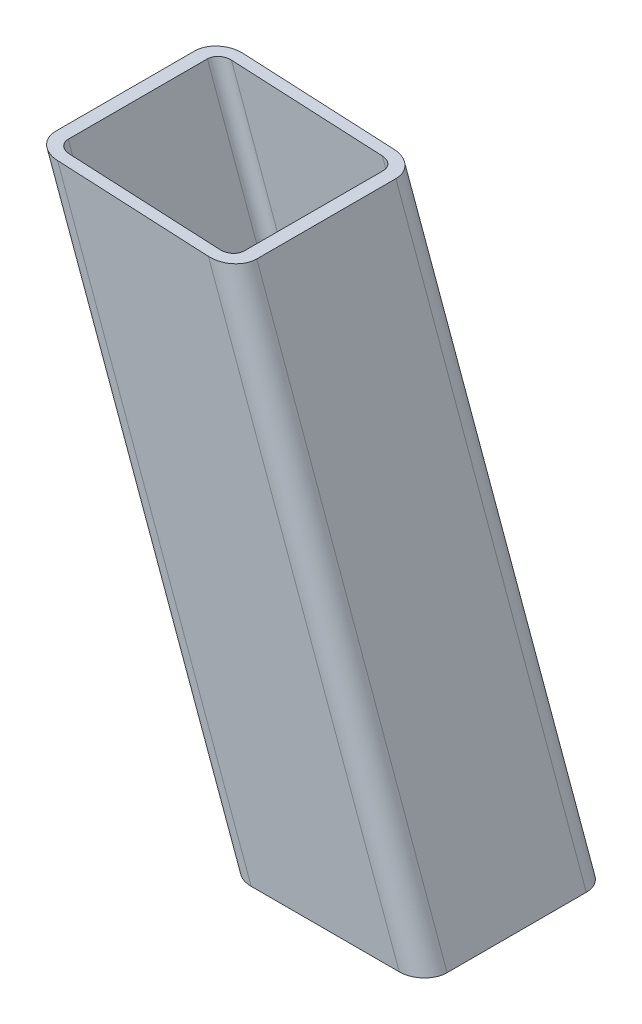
ISO-10303-21;
HEADER;
FILE_DESCRIPTION(('STEP AP214'),'2;1');
FILE_NAME('part.step','',(''),(''),'','','');
FILE_SCHEMA(('AUTOMOTIVE_DESIGN { 1 0 10303 214 1 1 1 1 }'));
ENDSEC;
DATA;
#1=APPLICATION_CONTEXT('core data for automotive mechanical design processes');
#2=APPLICATION_PROTOCOL_DEFINITION('international standard','automotive_design',2000,#1);
#3=PRODUCT_CONTEXT('',#1,'mechanical');
#4=PRODUCT('Part','Part','',(#3));
#5=PRODUCT_RELATED_PRODUCT_CATEGORY('part','',(#4));
#6=PRODUCT_DEFINITION_FORMATION('','',#4);
#7=PRODUCT_DEFINITION_CONTEXT('part definition',#1,'design');
#8=PRODUCT_DEFINITION('design','',#6,#7);
#9=PRODUCT_DEFINITION_SHAPE('','',#8);
#10=(LENGTH_UNIT() NAMED_UNIT(*) SI_UNIT(.MILLI.,.METRE.));
#11=(NAMED_UNIT(*) PLANE_ANGLE_UNIT() SI_UNIT($,.RADIAN.));
#12=(NAMED_UNIT(*) SI_UNIT($,.STERADIAN.) SOLID_ANGLE_UNIT());
#13=UNCERTAINTY_MEASURE_WITH_UNIT(LENGTH_MEASURE(1.E-05),#10,'distance_accuracy_value','');
#14=(GEOMETRIC_REPRESENTATION_CONTEXT(3) GLOBAL_UNCERTAINTY_ASSIGNED_CONTEXT((#13)) GLOBAL_UNIT_ASSIGNED_CONTEXT((#10,
#11,#12)) REPRESENTATION_CONTEXT('',''));
#15=CARTESIAN_POINT('',(0.,0.,0.));
#16=DIRECTION('',(0.,0.,1.));
#17=DIRECTION('',(1.,0.,0.));
#18=AXIS2_PLACEMENT_3D('',#15,#16,#17);
#19=CARTESIAN_POINT('',(1753.21678392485,13.6808057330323,30.));
#20=DIRECTION('',(-0.939692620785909,-0.342020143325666,0.));
#21=DIRECTION('',(0.342020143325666,-0.939692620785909,0.));
#22=AXIS2_PLACEMENT_3D('',#19,#20,#21);
#23=PLANE('',#22);
#24=DIRECTION('',(0.,0.,1.));
#25=VECTOR('',#24,1.);
#26=CARTESIAN_POINT('',(1737.44988663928,56.9999999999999,30.0000000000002));
#27=LINE('',#26,#25);
#28=CARTESIAN_POINT('',(1737.44988663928,57.,-30.));
#29=VERTEX_POINT('',#28);
#30=CARTESIAN_POINT('',(1737.44988663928,56.9999999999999,30.));
#31=VERTEX_POINT('',#30);
#32=EDGE_CURVE('E53',#29,#31,#27,.T.);
#33=ORIENTED_EDGE('',*,*,#32,.F.);
#34=DIRECTION('',(-0.342020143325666,0.939692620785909,0.));
#35=VECTOR('',#34,1.);
#36=CARTESIAN_POINT('',(1753.21678392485,13.6808057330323,-30.));
#37=LINE('',#36,#35);
#38=CARTESIAN_POINT('',(1655.37253947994,282.505657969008,-30.));
#39=VERTEX_POINT('',#38);
#40=EDGE_CURVE('E38',#29,#39,#37,.T.);
#41=ORIENTED_EDGE('',*,*,#40,.T.);
#42=DIRECTION('',(0.,0.,-1.));
#43=VECTOR('',#42,1.);
#44=CARTESIAN_POINT('',(1655.37253947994,282.505657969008,30.));
#45=LINE('',#44,#43);
#46=CARTESIAN_POINT('',(1655.37253947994,282.505657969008,30.));
#47=VERTEX_POINT('',#46);
#48=EDGE_CURVE('E107',#47,#39,#45,.T.);
#49=ORIENTED_EDGE('',*,*,#48,.F.);
#50=DIRECTION('',(-0.342020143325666,0.939692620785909,0.));
#51=VECTOR('',#50,1.);
#52=CARTESIAN_POINT('',(1753.21678392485,13.6808057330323,30.));
#53=LINE('',#52,#51);
#54=EDGE_CURVE('E185',#31,#47,#53,.T.);
#55=ORIENTED_EDGE('',*,*,#54,.F.);
#56=EDGE_LOOP('',(#33,#41,#49,#55));
#57=FACE_BOUND('',#56,.T.);
#58=ADVANCED_FACE('F34',(#57),#23,.F.);
#59=CARTESIAN_POINT('',(1743.81985771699,10.2606042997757,-30.));
#60=DIRECTION('',(-0.342020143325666,0.939692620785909,0.));
#61=DIRECTION('',(-0.939692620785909,-0.342020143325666,0.));
#62=AXIS2_PLACEMENT_3D('',#59,#60,#61);
#63=CYLINDRICAL_SURFACE('',#62,10.);
#64=CARTESIAN_POINT('',(1726.80810891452,57.0000000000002,-30.));
#65=DIRECTION('',(0.,-1.,0.));
#66=DIRECTION('',(-1.,0.,0.));
#67=AXIS2_PLACEMENT_3D('',#64,#65,#66);
#68=ELLIPSE('',#67,10.6417777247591,10.);
#69=CARTESIAN_POINT('',(1726.80810891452,57.0000000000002,-40.));
#70=VERTEX_POINT('',#69);
#71=EDGE_CURVE('E155',#70,#29,#68,.T.);
#72=ORIENTED_EDGE('',*,*,#71,.F.);
#73=DIRECTION('',(-0.342020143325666,0.939692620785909,0.));
#74=VECTOR('',#73,1.);
#75=CARTESIAN_POINT('',(1743.81985771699,10.2606042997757,-40.));
#76=LINE('',#75,#74);
#77=CARTESIAN_POINT('',(1644.53323300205,283.048363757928,-40.));
#78=VERTEX_POINT('',#77);
#79=EDGE_CURVE('E165',#70,#78,#76,.T.);
#80=ORIENTED_EDGE('',*,*,#79,.T.);
#81=CARTESIAN_POINT('',(1644.53323300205,283.048363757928,-30.));
#82=DIRECTION('',(0.0500056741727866,0.998748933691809,0.));
#83=DIRECTION('',(-0.998748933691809,0.0500056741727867,0.));
#84=AXIS2_PLACEMENT_3D('',#81,#82,#83);
#85=ELLIPSE('',#84,10.8528841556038,10.);
#86=EDGE_CURVE('E102',#39,#78,#85,.T.);
#87=ORIENTED_EDGE('',*,*,#86,.F.);
#88=ORIENTED_EDGE('',*,*,#40,.F.);
#89=EDGE_LOOP('',(#72,#80,#87,#88));
#90=FACE_BOUND('',#89,.T.);
#91=ADVANCED_FACE('F164',(#90),#63,.T.);
#92=CARTESIAN_POINT('',(1687.43830046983,-10.2606042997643,-40.));
#93=DIRECTION('',(0.,0.,1.));
#94=DIRECTION('',(1.,0.,0.));
#95=AXIS2_PLACEMENT_3D('',#92,#93,#94);
#96=PLANE('',#95);
#97=DIRECTION('',(1.,0.,0.));
#98=VECTOR('',#97,1.);
#99=CARTESIAN_POINT('',(1687.43830046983,57.0000000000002,-40.));
#100=LINE('',#99,#98);
#101=CARTESIAN_POINT('',(1662.95744256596,57.0000000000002,-40.));
#102=VERTEX_POINT('',#101);
#103=EDGE_CURVE('E152',#102,#70,#100,.T.);
#104=ORIENTED_EDGE('',*,*,#103,.F.);
#105=DIRECTION('',(-0.342020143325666,0.939692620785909,0.));
#106=VECTOR('',#105,1.);
#107=CARTESIAN_POINT('',(1687.43830046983,-10.2606042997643,-40.));
#108=LINE('',#107,#106);
#109=CARTESIAN_POINT('',(1579.49739413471,286.304598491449,-40.));
#110=VERTEX_POINT('',#109);
#111=EDGE_CURVE('E170',#102,#110,#108,.T.);
#112=ORIENTED_EDGE('',*,*,#111,.T.);
#113=DIRECTION('',(-0.998748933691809,0.0500056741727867,0.));
#114=VECTOR('',#113,1.);
#115=CARTESIAN_POINT('',(1701.97977661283,280.1721122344,-40.));
#116=LINE('',#115,#114);
#117=EDGE_CURVE('E169',#78,#110,#116,.T.);
#118=ORIENTED_EDGE('',*,*,#117,.F.);
#119=ORIENTED_EDGE('',*,*,#79,.F.);
#120=EDGE_LOOP('',(#104,#112,#118,#119));
#121=FACE_BOUND('',#120,.T.);
#122=ADVANCED_FACE('F168',(#121),#96,.F.);
#123=CARTESIAN_POINT('',(1687.43830046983,-10.2606042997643,-30.));
#124=DIRECTION('',(-0.342020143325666,0.939692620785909,0.));
#125=DIRECTION('',(-0.939692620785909,-0.342020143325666,0.));
#126=AXIS2_PLACEMENT_3D('',#123,#124,#125);
#127=CYLINDRICAL_SURFACE('',#126,10.);
#128=CARTESIAN_POINT('',(1662.95744256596,57.0000000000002,-30.));
#129=DIRECTION('',(0.,-1.,0.));
#130=DIRECTION('',(-1.,0.,0.));
#131=AXIS2_PLACEMENT_3D('',#128,#129,#130);
#132=ELLIPSE('',#131,10.6417777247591,10.);
#133=CARTESIAN_POINT('',(1652.3156648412,57.0000000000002,-30.));
#134=VERTEX_POINT('',#133);
#135=EDGE_CURVE('E150',#134,#102,#132,.T.);
#136=ORIENTED_EDGE('',*,*,#135,.F.);
#137=DIRECTION('',(-0.342020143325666,0.939692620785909,0.));
#138=VECTOR('',#137,1.);
#139=CARTESIAN_POINT('',(1678.04137426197,-13.680805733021,-30.));
#140=LINE('',#139,#138);
#141=CARTESIAN_POINT('',(1568.65808765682,286.847304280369,-30.));
#142=VERTEX_POINT('',#141);
#143=EDGE_CURVE('E171',#134,#142,#140,.T.);
#144=ORIENTED_EDGE('',*,*,#143,.T.);
#145=CARTESIAN_POINT('',(1579.49739413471,286.304598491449,-30.));
#146=DIRECTION('',(0.0500056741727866,0.998748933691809,0.));
#147=DIRECTION('',(-0.998748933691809,0.0500056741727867,0.));
#148=AXIS2_PLACEMENT_3D('',#145,#146,#147);
#149=ELLIPSE('',#148,10.8528841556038,10.);
#150=EDGE_CURVE('E228',#110,#142,#149,.T.);
#151=ORIENTED_EDGE('',*,*,#150,.F.);
#152=ORIENTED_EDGE('',*,*,#111,.F.);
#153=EDGE_LOOP('',(#136,#144,#151,#152));
#154=FACE_BOUND('',#153,.T.);
#155=ADVANCED_FACE('F325',(#154),#127,.T.);
#156=CARTESIAN_POINT('',(1678.04137426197,-13.680805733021,-30.));
#157=DIRECTION('',(0.939692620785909,0.342020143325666,0.));
#158=DIRECTION('',(-0.342020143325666,0.939692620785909,0.));
#159=AXIS2_PLACEMENT_3D('',#156,#157,#158);
#160=PLANE('',#159);
#161=DIRECTION('',(0.,0.,-1.));
#162=VECTOR('',#161,1.);
#163=CARTESIAN_POINT('',(1652.3156648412,57.0000000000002,-29.9999999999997));
#164=LINE('',#163,#162);
#165=CARTESIAN_POINT('',(1652.3156648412,56.9999999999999,30.));
#166=VERTEX_POINT('',#165);
#167=EDGE_CURVE('E253',#166,#134,#164,.T.);
#168=ORIENTED_EDGE('',*,*,#167,.F.);
#169=DIRECTION('',(-0.342020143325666,0.939692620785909,0.));
#170=VECTOR('',#169,1.);
#171=CARTESIAN_POINT('',(1678.04137426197,-13.6808057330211,30.));
#172=LINE('',#171,#170);
#173=CARTESIAN_POINT('',(1568.65808765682,286.847304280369,30.));
#174=VERTEX_POINT('',#173);
#175=EDGE_CURVE('E176',#166,#174,#172,.T.);
#176=ORIENTED_EDGE('',*,*,#175,.T.);
#177=DIRECTION('',(0.,0.,1.));
#178=VECTOR('',#177,1.);
#179=CARTESIAN_POINT('',(1568.65808765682,286.847304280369,-30.0000000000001));
#180=LINE('',#179,#178);
#181=EDGE_CURVE('E230',#142,#174,#180,.T.);
#182=ORIENTED_EDGE('',*,*,#181,.F.);
#183=ORIENTED_EDGE('',*,*,#143,.F.);
#184=EDGE_LOOP('',(#168,#176,#182,#183));
#185=FACE_BOUND('',#184,.T.);
#186=ADVANCED_FACE('F328',(#185),#160,.F.);
#187=CARTESIAN_POINT('',(1687.43830046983,-10.2606042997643,30.));
#188=DIRECTION('',(-0.342020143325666,0.939692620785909,0.));
#189=DIRECTION('',(-0.939692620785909,-0.342020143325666,0.));
#190=AXIS2_PLACEMENT_3D('',#187,#188,#189);
#191=CYLINDRICAL_SURFACE('',#190,10.);
#192=CARTESIAN_POINT('',(1662.95744256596,56.9999999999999,30.));
#193=DIRECTION('',(0.,-1.,0.));
#194=DIRECTION('',(-1.,0.,0.));
#195=AXIS2_PLACEMENT_3D('',#192,#193,#194);
#196=ELLIPSE('',#195,10.6417777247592,10.);
#197=CARTESIAN_POINT('',(1662.95744256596,56.9999999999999,40.));
#198=VERTEX_POINT('',#197);
#199=EDGE_CURVE('E255',#198,#166,#196,.T.);
#200=ORIENTED_EDGE('',*,*,#199,.F.);
#201=DIRECTION('',(-0.342020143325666,0.939692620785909,0.));
#202=VECTOR('',#201,1.);
#203=CARTESIAN_POINT('',(1687.43830046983,-10.2606042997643,40.));
#204=LINE('',#203,#202);
#205=CARTESIAN_POINT('',(1579.49739413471,286.304598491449,40.));
#206=VERTEX_POINT('',#205);
#207=EDGE_CURVE('E179',#198,#206,#204,.T.);
#208=ORIENTED_EDGE('',*,*,#207,.T.);
#209=CARTESIAN_POINT('',(1579.49739413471,286.304598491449,30.));
#210=DIRECTION('',(0.0500056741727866,0.998748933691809,0.));
#211=DIRECTION('',(-0.998748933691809,0.0500056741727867,0.));
#212=AXIS2_PLACEMENT_3D('',#209,#210,#211);
#213=ELLIPSE('',#212,10.8528841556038,10.);
#214=EDGE_CURVE('E232',#174,#206,#213,.T.);
#215=ORIENTED_EDGE('',*,*,#214,.F.);
#216=ORIENTED_EDGE('',*,*,#175,.F.);
#217=EDGE_LOOP('',(#200,#208,#215,#216));
#218=FACE_BOUND('',#217,.T.);
#219=ADVANCED_FACE('F332',(#218),#191,.T.);
#220=CARTESIAN_POINT('',(1743.81985771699,10.2606042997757,40.));
#221=DIRECTION('',(0.,0.,-1.));
#222=DIRECTION('',(-1.,0.,0.));
#223=AXIS2_PLACEMENT_3D('',#220,#221,#222);
#224=PLANE('',#223);
#225=DIRECTION('',(-1.,0.,0.));
#226=VECTOR('',#225,1.);
#227=CARTESIAN_POINT('',(1743.81985771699,56.9999999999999,40.));
#228=LINE('',#227,#226);
#229=CARTESIAN_POINT('',(1726.80810891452,56.9999999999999,40.));
#230=VERTEX_POINT('',#229);
#231=EDGE_CURVE('E257',#230,#198,#228,.T.);
#232=ORIENTED_EDGE('',*,*,#231,.F.);
#233=DIRECTION('',(-0.342020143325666,0.939692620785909,0.));
#234=VECTOR('',#233,1.);
#235=CARTESIAN_POINT('',(1743.81985771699,10.2606042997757,40.));
#236=LINE('',#235,#234);
#237=CARTESIAN_POINT('',(1644.53323300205,283.048363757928,40.));
#238=VERTEX_POINT('',#237);
#239=EDGE_CURVE('E182',#230,#238,#236,.T.);
#240=ORIENTED_EDGE('',*,*,#239,.T.);
#241=DIRECTION('',(0.998748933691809,-0.0500056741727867,0.));
#242=VECTOR('',#241,1.);
#243=CARTESIAN_POINT('',(1757.19545491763,277.407556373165,40.));
#244=LINE('',#243,#242);
#245=EDGE_CURVE('E234',#206,#238,#244,.T.);
#246=ORIENTED_EDGE('',*,*,#245,.F.);
#247=ORIENTED_EDGE('',*,*,#207,.F.);
#248=EDGE_LOOP('',(#232,#240,#246,#247));
#249=FACE_BOUND('',#248,.T.);
#250=ADVANCED_FACE('F335',(#249),#224,.F.);
#251=CARTESIAN_POINT('',(1743.81985771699,10.2606042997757,30.));
#252=DIRECTION('',(-0.342020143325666,0.939692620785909,0.));
#253=DIRECTION('',(-0.939692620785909,-0.342020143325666,0.));
#254=AXIS2_PLACEMENT_3D('',#251,#252,#253);
#255=CYLINDRICAL_SURFACE('',#254,10.);
#256=CARTESIAN_POINT('',(1726.80810891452,56.9999999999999,30.));
#257=DIRECTION('',(0.,-1.,0.));
#258=DIRECTION('',(-1.,0.,0.));
#259=AXIS2_PLACEMENT_3D('',#256,#257,#258);
#260=ELLIPSE('',#259,10.6417777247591,10.);
#261=EDGE_CURVE('E236',#31,#230,#260,.T.);
#262=ORIENTED_EDGE('',*,*,#261,.F.);
#263=ORIENTED_EDGE('',*,*,#54,.T.);
#264=CARTESIAN_POINT('',(1644.53323300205,283.048363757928,30.));
#265=DIRECTION('',(0.0500056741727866,0.998748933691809,0.));
#266=DIRECTION('',(-0.998748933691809,0.0500056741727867,0.));
#267=AXIS2_PLACEMENT_3D('',#264,#265,#266);
#268=ELLIPSE('',#267,10.8528841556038,10.);
#269=EDGE_CURVE('E110',#238,#47,#268,.T.);
#270=ORIENTED_EDGE('',*,*,#269,.F.);
#271=ORIENTED_EDGE('',*,*,#239,.F.);
#272=EDGE_LOOP('',(#262,#263,#270,#271));
#273=FACE_BOUND('',#272,.T.);
#274=ADVANCED_FACE('F36',(#273),#255,.T.);
#275=CARTESIAN_POINT('',(6158.08276398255,57.0625533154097,-40.));
#276=DIRECTION('',(0.0500056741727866,0.998748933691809,0.));
#277=DIRECTION('',(-0.998748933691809,0.0500056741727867,0.));
#278=AXIS2_PLACEMENT_3D('',#275,#276,#277);
#279=PLANE('',#278);
#280=DIRECTION('',(0.,0.,1.));
#281=VECTOR('',#280,1.);
#282=CARTESIAN_POINT('',(1574.07774089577,286.575951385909,-30.));
#283=LINE('',#282,#281);
#284=CARTESIAN_POINT('',(1574.07774089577,286.575951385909,-30.));
#285=VERTEX_POINT('',#284);
#286=CARTESIAN_POINT('',(1574.07774089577,286.575951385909,30.));
#287=VERTEX_POINT('',#286);
#288=EDGE_CURVE('E191',#285,#287,#283,.T.);
#289=ORIENTED_EDGE('',*,*,#288,.F.);
#290=CARTESIAN_POINT('',(1579.49739413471,286.304598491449,-30.));
#291=DIRECTION('',(0.0500056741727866,0.998748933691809,0.));
#292=DIRECTION('',(-0.998748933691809,0.0500056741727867,0.));
#293=AXIS2_PLACEMENT_3D('',#290,#291,#292);
#294=ELLIPSE('',#293,5.4264420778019,5.00000000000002);
#295=CARTESIAN_POINT('',(1579.49739413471,286.304598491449,-35.));
#296=VERTEX_POINT('',#295);
#297=EDGE_CURVE('E196',#296,#285,#294,.T.);
#298=ORIENTED_EDGE('',*,*,#297,.F.);
#299=DIRECTION('',(-0.998748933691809,0.0500056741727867,0.));
#300=VECTOR('',#299,1.);
#301=CARTESIAN_POINT('',(1701.97977661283,280.1721122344,-35.));
#302=LINE('',#301,#300);
#303=CARTESIAN_POINT('',(1644.53323300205,283.048363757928,-35.));
#304=VERTEX_POINT('',#303);
#305=EDGE_CURVE('E201',#304,#296,#302,.T.);
#306=ORIENTED_EDGE('',*,*,#305,.F.);
#307=CARTESIAN_POINT('',(1644.53323300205,283.048363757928,-30.));
#308=DIRECTION('',(0.0500056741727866,0.998748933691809,0.));
#309=DIRECTION('',(-0.998748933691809,0.0500056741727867,0.));
#310=AXIS2_PLACEMENT_3D('',#307,#308,#309);
#311=ELLIPSE('',#310,5.42644207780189,5.00000000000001);
#312=CARTESIAN_POINT('',(1649.952886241,282.777010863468,-30.));
#313=VERTEX_POINT('',#312);
#314=EDGE_CURVE('E206',#313,#304,#311,.T.);
#315=ORIENTED_EDGE('',*,*,#314,.F.);
#316=DIRECTION('',(0.,0.,-1.));
#317=VECTOR('',#316,1.);
#318=CARTESIAN_POINT('',(1649.952886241,282.777010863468,30.));
#319=LINE('',#318,#317);
#320=CARTESIAN_POINT('',(1649.952886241,282.777010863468,30.));
#321=VERTEX_POINT('',#320);
#322=EDGE_CURVE('E211',#321,#313,#319,.T.);
#323=ORIENTED_EDGE('',*,*,#322,.F.);
#324=CARTESIAN_POINT('',(1644.53323300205,283.048363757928,30.));
#325=DIRECTION('',(0.0500056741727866,0.998748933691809,0.));
#326=DIRECTION('',(-0.998748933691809,0.0500056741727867,0.));
#327=AXIS2_PLACEMENT_3D('',#324,#325,#326);
#328=ELLIPSE('',#327,5.42644207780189,5.00000000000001);
#329=CARTESIAN_POINT('',(1644.53323300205,283.048363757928,35.));
#330=VERTEX_POINT('',#329);
#331=EDGE_CURVE('E216',#330,#321,#328,.T.);
#332=ORIENTED_EDGE('',*,*,#331,.F.);
#333=DIRECTION('',(0.998748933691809,-0.0500056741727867,0.));
#334=VECTOR('',#333,1.);
#335=CARTESIAN_POINT('',(1757.19545491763,277.407556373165,35.));
#336=LINE('',#335,#334);
#337=CARTESIAN_POINT('',(1579.49739413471,286.304598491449,35.));
#338=VERTEX_POINT('',#337);
#339=EDGE_CURVE('E221',#338,#330,#336,.T.);
#340=ORIENTED_EDGE('',*,*,#339,.F.);
#341=CARTESIAN_POINT('',(1579.49739413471,286.304598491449,30.));
#342=DIRECTION('',(0.0500056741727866,0.998748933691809,0.));
#343=DIRECTION('',(-0.998748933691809,0.0500056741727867,0.));
#344=AXIS2_PLACEMENT_3D('',#341,#342,#343);
#345=ELLIPSE('',#344,5.42644207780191,5.00000000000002);
#346=EDGE_CURVE('E11',#287,#338,#345,.T.);
#347=ORIENTED_EDGE('',*,*,#346,.F.);
#348=EDGE_LOOP('',(#289,#298,#306,#315,#323,#332,#340,#347));
#349=FACE_BOUND('',#348,.T.);
#350=ORIENTED_EDGE('',*,*,#269,.T.);
#351=ORIENTED_EDGE('',*,*,#48,.T.);
#352=ORIENTED_EDGE('',*,*,#86,.T.);
#353=ORIENTED_EDGE('',*,*,#117,.T.);
#354=ORIENTED_EDGE('',*,*,#150,.T.);
#355=ORIENTED_EDGE('',*,*,#181,.T.);
#356=ORIENTED_EDGE('',*,*,#214,.T.);
#357=ORIENTED_EDGE('',*,*,#245,.T.);
#358=EDGE_LOOP('',(#350,#351,#352,#353,#354,#355,#356,#357));
#359=FACE_BOUND('',#358,.T.);
#360=ADVANCED_FACE('F286',(#349,#359),#279,.T.);
#361=CARTESIAN_POINT('',(9149.96897120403,57.0000000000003,-59.9999999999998));
#362=DIRECTION('',(0.,-1.,0.));
#363=DIRECTION('',(0.,0.,-1.));
#364=AXIS2_PLACEMENT_3D('',#361,#362,#363);
#365=PLANE('',#364);
#366=DIRECTION('',(-1.,0.,0.));
#367=VECTOR('',#366,1.);
#368=CARTESIAN_POINT('',(1743.81985771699,56.9999999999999,35.));
#369=LINE('',#368,#367);
#370=CARTESIAN_POINT('',(1726.80810891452,56.9999999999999,35.));
#371=VERTEX_POINT('',#370);
#372=CARTESIAN_POINT('',(1662.95744256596,56.9999999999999,35.));
#373=VERTEX_POINT('',#372);
#374=EDGE_CURVE('E222',#371,#373,#369,.T.);
#375=ORIENTED_EDGE('',*,*,#374,.F.);
#376=CARTESIAN_POINT('',(1726.80810891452,56.9999999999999,30.));
#377=DIRECTION('',(0.,-1.,0.));
#378=DIRECTION('',(-1.,0.,0.));
#379=AXIS2_PLACEMENT_3D('',#376,#377,#378);
#380=ELLIPSE('',#379,5.32088886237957,5.00000000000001);
#381=CARTESIAN_POINT('',(1732.1289977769,56.9999999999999,30.));
#382=VERTEX_POINT('',#381);
#383=EDGE_CURVE('E217',#382,#371,#380,.T.);
#384=ORIENTED_EDGE('',*,*,#383,.F.);
#385=DIRECTION('',(0.,0.,1.));
#386=VECTOR('',#385,1.);
#387=CARTESIAN_POINT('',(1732.1289977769,56.9999999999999,30.0000000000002));
#388=LINE('',#387,#386);
#389=CARTESIAN_POINT('',(1732.1289977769,57.0000000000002,-30.));
#390=VERTEX_POINT('',#389);
#391=EDGE_CURVE('E212',#390,#382,#388,.T.);
#392=ORIENTED_EDGE('',*,*,#391,.F.);
#393=CARTESIAN_POINT('',(1726.80810891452,57.0000000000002,-30.));
#394=DIRECTION('',(0.,-1.,0.));
#395=DIRECTION('',(-1.,0.,0.));
#396=AXIS2_PLACEMENT_3D('',#393,#394,#395);
#397=ELLIPSE('',#396,5.32088886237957,5.00000000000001);
#398=CARTESIAN_POINT('',(1726.80810891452,57.0000000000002,-35.));
#399=VERTEX_POINT('',#398);
#400=EDGE_CURVE('E207',#399,#390,#397,.T.);
#401=ORIENTED_EDGE('',*,*,#400,.F.);
#402=DIRECTION('',(1.,0.,0.));
#403=VECTOR('',#402,1.);
#404=CARTESIAN_POINT('',(1687.43830046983,57.0000000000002,-35.));
#405=LINE('',#404,#403);
#406=CARTESIAN_POINT('',(1662.95744256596,57.0000000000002,-35.));
#407=VERTEX_POINT('',#406);
#408=EDGE_CURVE('E202',#407,#399,#405,.T.);
#409=ORIENTED_EDGE('',*,*,#408,.F.);
#410=CARTESIAN_POINT('',(1662.95744256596,57.0000000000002,-30.));
#411=DIRECTION('',(0.,-1.,0.));
#412=DIRECTION('',(-1.,0.,0.));
#413=AXIS2_PLACEMENT_3D('',#410,#411,#412);
#414=ELLIPSE('',#413,5.32088886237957,5.00000000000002);
#415=CARTESIAN_POINT('',(1657.63655370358,57.0000000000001,-30.));
#416=VERTEX_POINT('',#415);
#417=EDGE_CURVE('E197',#416,#407,#414,.T.);
#418=ORIENTED_EDGE('',*,*,#417,.F.);
#419=DIRECTION('',(0.,0.,-1.));
#420=VECTOR('',#419,1.);
#421=CARTESIAN_POINT('',(1657.63655370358,57.0000000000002,-29.9999999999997));
#422=LINE('',#421,#420);
#423=CARTESIAN_POINT('',(1657.63655370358,56.9999999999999,30.));
#424=VERTEX_POINT('',#423);
#425=EDGE_CURVE('E192',#424,#416,#422,.T.);
#426=ORIENTED_EDGE('',*,*,#425,.F.);
#427=CARTESIAN_POINT('',(1662.95744256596,56.9999999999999,30.));
#428=DIRECTION('',(0.,-1.,0.));
#429=DIRECTION('',(-1.,0.,0.));
#430=AXIS2_PLACEMENT_3D('',#427,#428,#429);
#431=ELLIPSE('',#430,5.32088886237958,5.00000000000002);
#432=EDGE_CURVE('E225',#373,#424,#431,.T.);
#433=ORIENTED_EDGE('',*,*,#432,.F.);
#434=EDGE_LOOP('',(#375,#384,#392,#401,#409,#418,#426,#433));
#435=FACE_BOUND('',#434,.T.);
#436=ORIENTED_EDGE('',*,*,#261,.T.);
#437=ORIENTED_EDGE('',*,*,#231,.T.);
#438=ORIENTED_EDGE('',*,*,#199,.T.);
#439=ORIENTED_EDGE('',*,*,#167,.T.);
#440=ORIENTED_EDGE('',*,*,#135,.T.);
#441=ORIENTED_EDGE('',*,*,#103,.T.);
#442=ORIENTED_EDGE('',*,*,#71,.T.);
#443=ORIENTED_EDGE('',*,*,#32,.T.);
#444=EDGE_LOOP('',(#436,#437,#438,#439,#440,#441,#442,#443));
#445=FACE_BOUND('',#444,.T.);
#446=ADVANCED_FACE('F154',(#435,#445),#365,.T.);
#447=CARTESIAN_POINT('',(1682.7398373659,-11.9707050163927,-30.));
#448=DIRECTION('',(0.939692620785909,0.342020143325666,0.));
#449=DIRECTION('',(-0.342020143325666,0.939692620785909,0.));
#450=AXIS2_PLACEMENT_3D('',#447,#448,#449);
#451=PLANE('',#450);
#452=DIRECTION('',(-0.342020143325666,0.939692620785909,0.));
#453=VECTOR('',#452,1.);
#454=CARTESIAN_POINT('',(1682.7398373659,-11.9707050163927,30.));
#455=LINE('',#454,#453);
#456=EDGE_CURVE('E44',#424,#287,#455,.T.);
#457=ORIENTED_EDGE('',*,*,#456,.F.);
#458=ORIENTED_EDGE('',*,*,#425,.T.);
#459=DIRECTION('',(-0.342020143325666,0.939692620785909,0.));
#460=VECTOR('',#459,1.);
#461=CARTESIAN_POINT('',(1682.7398373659,-11.9707050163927,-30.));
#462=LINE('',#461,#460);
#463=EDGE_CURVE('E188',#416,#285,#462,.T.);
#464=ORIENTED_EDGE('',*,*,#463,.T.);
#465=ORIENTED_EDGE('',*,*,#288,.T.);
#466=EDGE_LOOP('',(#457,#458,#464,#465));
#467=FACE_BOUND('',#466,.T.);
#468=ADVANCED_FACE('F283',(#467),#451,.T.);
#469=CARTESIAN_POINT('',(1687.43830046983,-10.2606042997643,-30.));
#470=DIRECTION('',(-0.342020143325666,0.939692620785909,0.));
#471=DIRECTION('',(-0.939692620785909,-0.342020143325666,0.));
#472=AXIS2_PLACEMENT_3D('',#469,#470,#471);
#473=CYLINDRICAL_SURFACE('',#472,5.00000000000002);
#474=ORIENTED_EDGE('',*,*,#463,.F.);
#475=ORIENTED_EDGE('',*,*,#417,.T.);
#476=DIRECTION('',(-0.342020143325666,0.939692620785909,0.));
#477=VECTOR('',#476,1.);
#478=CARTESIAN_POINT('',(1687.43830046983,-10.2606042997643,-35.));
#479=LINE('',#478,#477);
#480=EDGE_CURVE('E193',#407,#296,#479,.T.);
#481=ORIENTED_EDGE('',*,*,#480,.T.);
#482=ORIENTED_EDGE('',*,*,#297,.T.);
#483=EDGE_LOOP('',(#474,#475,#481,#482));
#484=FACE_BOUND('',#483,.T.);
#485=ADVANCED_FACE('F288',(#484),#473,.F.);
#486=CARTESIAN_POINT('',(1687.43830046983,-10.2606042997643,-35.));
#487=DIRECTION('',(0.,0.,1.));
#488=DIRECTION('',(1.,0.,0.));
#489=AXIS2_PLACEMENT_3D('',#486,#487,#488);
#490=PLANE('',#489);
#491=ORIENTED_EDGE('',*,*,#480,.F.);
#492=ORIENTED_EDGE('',*,*,#408,.T.);
#493=DIRECTION('',(-0.342020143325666,0.939692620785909,0.));
#494=VECTOR('',#493,1.);
#495=CARTESIAN_POINT('',(1743.81985771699,10.2606042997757,-35.));
#496=LINE('',#495,#494);
#497=EDGE_CURVE('E198',#399,#304,#496,.T.);
#498=ORIENTED_EDGE('',*,*,#497,.T.);
#499=ORIENTED_EDGE('',*,*,#305,.T.);
#500=EDGE_LOOP('',(#491,#492,#498,#499));
#501=FACE_BOUND('',#500,.T.);
#502=ADVANCED_FACE('F292',(#501),#490,.T.);
#503=CARTESIAN_POINT('',(1743.81985771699,10.2606042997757,-30.));
#504=DIRECTION('',(-0.342020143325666,0.939692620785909,0.));
#505=DIRECTION('',(-0.939692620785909,-0.342020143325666,0.));
#506=AXIS2_PLACEMENT_3D('',#503,#504,#505);
#507=CYLINDRICAL_SURFACE('',#506,5.00000000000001);
#508=ORIENTED_EDGE('',*,*,#497,.F.);
#509=ORIENTED_EDGE('',*,*,#400,.T.);
#510=DIRECTION('',(-0.342020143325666,0.939692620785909,0.));
#511=VECTOR('',#510,1.);
#512=CARTESIAN_POINT('',(1748.51832082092,11.970705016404,-30.));
#513=LINE('',#512,#511);
#514=EDGE_CURVE('E203',#390,#313,#513,.T.);
#515=ORIENTED_EDGE('',*,*,#514,.T.);
#516=ORIENTED_EDGE('',*,*,#314,.T.);
#517=EDGE_LOOP('',(#508,#509,#515,#516));
#518=FACE_BOUND('',#517,.T.);
#519=ADVANCED_FACE('F295',(#518),#507,.F.);
#520=CARTESIAN_POINT('',(1748.51832082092,11.970705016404,30.));
#521=DIRECTION('',(-0.939692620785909,-0.342020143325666,0.));
#522=DIRECTION('',(0.342020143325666,-0.939692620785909,0.));
#523=AXIS2_PLACEMENT_3D('',#520,#521,#522);
#524=PLANE('',#523);
#525=ORIENTED_EDGE('',*,*,#514,.F.);
#526=ORIENTED_EDGE('',*,*,#391,.T.);
#527=DIRECTION('',(-0.342020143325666,0.939692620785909,0.));
#528=VECTOR('',#527,1.);
#529=CARTESIAN_POINT('',(1748.51832082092,11.970705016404,30.));
#530=LINE('',#529,#528);
#531=EDGE_CURVE('E208',#382,#321,#530,.T.);
#532=ORIENTED_EDGE('',*,*,#531,.T.);
#533=ORIENTED_EDGE('',*,*,#322,.T.);
#534=EDGE_LOOP('',(#525,#526,#532,#533));
#535=FACE_BOUND('',#534,.T.);
#536=ADVANCED_FACE('F298',(#535),#524,.T.);
#537=CARTESIAN_POINT('',(1743.81985771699,10.2606042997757,30.));
#538=DIRECTION('',(-0.342020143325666,0.939692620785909,0.));
#539=DIRECTION('',(-0.939692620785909,-0.342020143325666,0.));
#540=AXIS2_PLACEMENT_3D('',#537,#538,#539);
#541=CYLINDRICAL_SURFACE('',#540,5.00000000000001);
#542=ORIENTED_EDGE('',*,*,#531,.F.);
#543=ORIENTED_EDGE('',*,*,#383,.T.);
#544=DIRECTION('',(-0.342020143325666,0.939692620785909,0.));
#545=VECTOR('',#544,1.);
#546=CARTESIAN_POINT('',(1743.81985771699,10.2606042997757,35.));
#547=LINE('',#546,#545);
#548=EDGE_CURVE('E213',#371,#330,#547,.T.);
#549=ORIENTED_EDGE('',*,*,#548,.T.);
#550=ORIENTED_EDGE('',*,*,#331,.T.);
#551=EDGE_LOOP('',(#542,#543,#549,#550));
#552=FACE_BOUND('',#551,.T.);
#553=ADVANCED_FACE('F301',(#552),#541,.F.);
#554=CARTESIAN_POINT('',(1743.81985771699,10.2606042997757,35.));
#555=DIRECTION('',(0.,0.,-1.));
#556=DIRECTION('',(-1.,0.,0.));
#557=AXIS2_PLACEMENT_3D('',#554,#555,#556);
#558=PLANE('',#557);
#559=ORIENTED_EDGE('',*,*,#548,.F.);
#560=ORIENTED_EDGE('',*,*,#374,.T.);
#561=DIRECTION('',(-0.342020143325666,0.939692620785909,0.));
#562=VECTOR('',#561,1.);
#563=CARTESIAN_POINT('',(1687.43830046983,-10.2606042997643,35.));
#564=LINE('',#563,#562);
#565=EDGE_CURVE('E218',#373,#338,#564,.T.);
#566=ORIENTED_EDGE('',*,*,#565,.T.);
#567=ORIENTED_EDGE('',*,*,#339,.T.);
#568=EDGE_LOOP('',(#559,#560,#566,#567));
#569=FACE_BOUND('',#568,.T.);
#570=ADVANCED_FACE('F304',(#569),#558,.T.);
#571=CARTESIAN_POINT('',(1687.43830046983,-10.2606042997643,30.));
#572=DIRECTION('',(-0.342020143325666,0.939692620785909,0.));
#573=DIRECTION('',(-0.939692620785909,-0.342020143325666,0.));
#574=AXIS2_PLACEMENT_3D('',#571,#572,#573);
#575=CYLINDRICAL_SURFACE('',#574,5.00000000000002);
#576=ORIENTED_EDGE('',*,*,#565,.F.);
#577=ORIENTED_EDGE('',*,*,#432,.T.);
#578=ORIENTED_EDGE('',*,*,#456,.T.);
#579=ORIENTED_EDGE('',*,*,#346,.T.);
#580=EDGE_LOOP('',(#576,#577,#578,#579));
#581=FACE_BOUND('',#580,.T.);
#582=ADVANCED_FACE('F280',(#581),#575,.F.);
#583=CLOSED_SHELL('',(#58,#91,#122,#155,#186,#219,#250,#274,#360,#446,#468,#485,#502,#519,#536,
#553,#570,#582));
#584=MANIFOLD_SOLID_BREP('B2',#583);
#585=ADVANCED_BREP_SHAPE_REPRESENTATION('',(#18,#584),#14);
#586=SHAPE_DEFINITION_REPRESENTATION(#9,#585);
ENDSEC;
END-ISO-10303-21;
